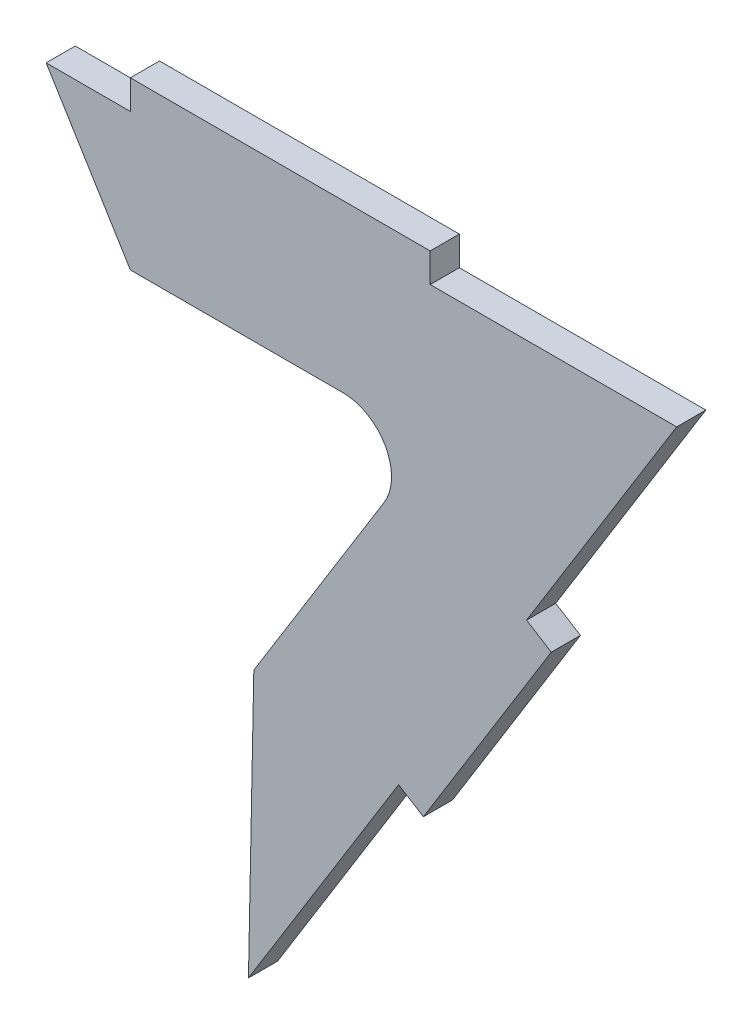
ISO-10303-21;
HEADER;
FILE_DESCRIPTION(('STEP AP214'),'2;1');
FILE_NAME('part.step','',(''),(''),'','','');
FILE_SCHEMA(('AUTOMOTIVE_DESIGN { 1 0 10303 214 1 1 1 1 }'));
ENDSEC;
DATA;
#1=APPLICATION_CONTEXT('core data for automotive mechanical design processes');
#2=APPLICATION_PROTOCOL_DEFINITION('international standard','automotive_design',2000,#1);
#3=PRODUCT_CONTEXT('',#1,'mechanical');
#4=PRODUCT('Part','Part','',(#3));
#5=PRODUCT_RELATED_PRODUCT_CATEGORY('part','',(#4));
#6=PRODUCT_DEFINITION_FORMATION('','',#4);
#7=PRODUCT_DEFINITION_CONTEXT('part definition',#1,'design');
#8=PRODUCT_DEFINITION('design','',#6,#7);
#9=PRODUCT_DEFINITION_SHAPE('','',#8);
#10=(LENGTH_UNIT() NAMED_UNIT(*) SI_UNIT(.MILLI.,.METRE.));
#11=(NAMED_UNIT(*) PLANE_ANGLE_UNIT() SI_UNIT($,.RADIAN.));
#12=(NAMED_UNIT(*) SI_UNIT($,.STERADIAN.) SOLID_ANGLE_UNIT());
#13=UNCERTAINTY_MEASURE_WITH_UNIT(LENGTH_MEASURE(1.E-05),#10,'distance_accuracy_value','');
#14=(GEOMETRIC_REPRESENTATION_CONTEXT(3) GLOBAL_UNCERTAINTY_ASSIGNED_CONTEXT((#13)) GLOBAL_UNIT_ASSIGNED_CONTEXT((#10,
#11,#12)) REPRESENTATION_CONTEXT('',''));
#15=CARTESIAN_POINT('',(0.,0.,0.));
#16=DIRECTION('',(0.,0.,1.));
#17=DIRECTION('',(1.,0.,0.));
#18=AXIS2_PLACEMENT_3D('',#15,#16,#17);
#19=CARTESIAN_POINT('',(40.2472484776,0.,1.524));
#20=DIRECTION('',(0.,-1.,0.));
#21=DIRECTION('',(1.,0.,0.));
#22=AXIS2_PLACEMENT_3D('',#19,#20,#21);
#23=PLANE('',#22);
#24=DIRECTION('',(-1.,0.,0.));
#25=VECTOR('',#24,1.);
#26=CARTESIAN_POINT('',(40.2472484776,0.,0.));
#27=LINE('',#26,#25);
#28=CARTESIAN_POINT('',(44.649794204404,0.,0.));
#29=VERTEX_POINT('',#28);
#30=CARTESIAN_POINT('',(40.2472484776,0.,0.));
#31=VERTEX_POINT('',#30);
#32=EDGE_CURVE('E174',#29,#31,#27,.T.);
#33=ORIENTED_EDGE('',*,*,#32,.T.);
#34=DIRECTION('',(0.,0.,-1.));
#35=VECTOR('',#34,1.);
#36=CARTESIAN_POINT('',(40.2472484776,0.,1.524));
#37=LINE('',#36,#35);
#38=CARTESIAN_POINT('',(40.2472484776,0.,1.524));
#39=VERTEX_POINT('',#38);
#40=EDGE_CURVE('E11',#39,#31,#37,.T.);
#41=ORIENTED_EDGE('',*,*,#40,.F.);
#42=DIRECTION('',(-1.,0.,0.));
#43=VECTOR('',#42,1.);
#44=CARTESIAN_POINT('',(40.2472484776,0.,1.524));
#45=LINE('',#44,#43);
#46=CARTESIAN_POINT('',(44.649794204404,0.,1.524));
#47=VERTEX_POINT('',#46);
#48=EDGE_CURVE('E202',#47,#39,#45,.T.);
#49=ORIENTED_EDGE('',*,*,#48,.F.);
#50=DIRECTION('',(0.,0.,-1.));
#51=VECTOR('',#50,1.);
#52=CARTESIAN_POINT('',(44.649794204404,0.,1.524));
#53=LINE('',#52,#51);
#54=EDGE_CURVE('E170',#47,#29,#53,.T.);
#55=ORIENTED_EDGE('',*,*,#54,.T.);
#56=EDGE_LOOP('',(#33,#41,#49,#55));
#57=FACE_BOUND('',#56,.T.);
#58=ADVANCED_FACE('F36',(#57),#23,.F.);
#59=CARTESIAN_POINT('',(40.2472484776,0.,1.524));
#60=DIRECTION('',(0.852442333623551,0.522821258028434,0.));
#61=DIRECTION('',(-0.522821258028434,0.852442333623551,0.));
#62=AXIS2_PLACEMENT_3D('',#59,#60,#61);
#63=PLANE('',#62);
#64=DIRECTION('',(0.522821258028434,-0.852442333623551,0.));
#65=VECTOR('',#64,1.);
#66=CARTESIAN_POINT('',(40.2472484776,0.,0.));
#67=LINE('',#66,#65);
#68=CARTESIAN_POINT('',(44.649794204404,-7.17820152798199,0.));
#69=VERTEX_POINT('',#68);
#70=EDGE_CURVE('E177',#31,#69,#67,.T.);
#71=ORIENTED_EDGE('',*,*,#70,.T.);
#72=DIRECTION('',(0.,0.,-1.));
#73=VECTOR('',#72,1.);
#74=CARTESIAN_POINT('',(44.649794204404,-7.17820152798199,1.524));
#75=LINE('',#74,#73);
#76=CARTESIAN_POINT('',(44.649794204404,-7.17820152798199,1.524));
#77=VERTEX_POINT('',#76);
#78=EDGE_CURVE('E44',#77,#69,#75,.T.);
#79=ORIENTED_EDGE('',*,*,#78,.F.);
#80=DIRECTION('',(0.522821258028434,-0.852442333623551,0.));
#81=VECTOR('',#80,1.);
#82=CARTESIAN_POINT('',(40.2472484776,0.,1.524));
#83=LINE('',#82,#81);
#84=EDGE_CURVE('E116',#39,#77,#83,.T.);
#85=ORIENTED_EDGE('',*,*,#84,.F.);
#86=ORIENTED_EDGE('',*,*,#40,.T.);
#87=EDGE_LOOP('',(#71,#79,#85,#86));
#88=FACE_BOUND('',#87,.T.);
#89=ADVANCED_FACE('F295',(#88),#63,.F.);
#90=CARTESIAN_POINT('',(55.7656315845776,-7.17820152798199,1.524));
#91=DIRECTION('',(0.,1.,0.));
#92=DIRECTION('',(0.,0.,1.));
#93=AXIS2_PLACEMENT_3D('',#90,#91,#92);
#94=PLANE('',#93);
#95=DIRECTION('',(1.,0.,0.));
#96=VECTOR('',#95,1.);
#97=CARTESIAN_POINT('',(55.7656315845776,-7.17820152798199,0.));
#98=LINE('',#97,#96);
#99=CARTESIAN_POINT('',(55.7656315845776,-7.17820152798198,0.));
#100=VERTEX_POINT('',#99);
#101=EDGE_CURVE('E179',#69,#100,#98,.T.);
#102=ORIENTED_EDGE('',*,*,#101,.T.);
#103=DIRECTION('',(0.,0.,-1.));
#104=VECTOR('',#103,1.);
#105=CARTESIAN_POINT('',(55.7656315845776,-7.17820152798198,1.524));
#106=LINE('',#105,#104);
#107=CARTESIAN_POINT('',(55.7656315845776,-7.17820152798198,1.524));
#108=VERTEX_POINT('',#107);
#109=EDGE_CURVE('E230',#108,#100,#106,.T.);
#110=ORIENTED_EDGE('',*,*,#109,.F.);
#111=DIRECTION('',(1.,0.,0.));
#112=VECTOR('',#111,1.);
#113=CARTESIAN_POINT('',(55.7656315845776,-7.17820152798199,1.524));
#114=LINE('',#113,#112);
#115=EDGE_CURVE('E238',#77,#108,#114,.T.);
#116=ORIENTED_EDGE('',*,*,#115,.F.);
#117=ORIENTED_EDGE('',*,*,#78,.T.);
#118=EDGE_LOOP('',(#102,#110,#116,#117));
#119=FACE_BOUND('',#118,.T.);
#120=ADVANCED_FACE('F236',(#119),#94,.F.);
#121=CARTESIAN_POINT('',(55.7656315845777,-9.71820152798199,1.524));
#122=DIRECTION('',(0.,0.,-1.));
#123=DIRECTION('',(-1.,0.,0.));
#124=AXIS2_PLACEMENT_3D('',#121,#122,#123);
#125=CYLINDRICAL_SURFACE('',#124,2.54);
#126=CARTESIAN_POINT('',(55.7656315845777,-9.71820152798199,0.));
#127=DIRECTION('',(0.,0.,-1.));
#128=DIRECTION('',(1.,0.,0.));
#129=AXIS2_PLACEMENT_3D('',#126,#127,#128);
#130=CIRCLE('',#129,2.54);
#131=CARTESIAN_POINT('',(57.9249608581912,-11.055698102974,0.));
#132=VERTEX_POINT('',#131);
#133=EDGE_CURVE('E181',#100,#132,#130,.T.);
#134=ORIENTED_EDGE('',*,*,#133,.T.);
#135=DIRECTION('',(0.,0.,-1.));
#136=VECTOR('',#135,1.);
#137=CARTESIAN_POINT('',(57.9249608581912,-11.055698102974,1.524));
#138=LINE('',#137,#136);
#139=CARTESIAN_POINT('',(57.9249608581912,-11.055698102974,1.524));
#140=VERTEX_POINT('',#139);
#141=EDGE_CURVE('E227',#140,#132,#138,.T.);
#142=ORIENTED_EDGE('',*,*,#141,.F.);
#143=CARTESIAN_POINT('',(55.7656315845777,-9.71820152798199,1.524));
#144=DIRECTION('',(0.,0.,-1.));
#145=DIRECTION('',(1.,0.,0.));
#146=AXIS2_PLACEMENT_3D('',#143,#144,#145);
#147=CIRCLE('',#146,2.54);
#148=EDGE_CURVE('E256',#108,#140,#147,.T.);
#149=ORIENTED_EDGE('',*,*,#148,.F.);
#150=ORIENTED_EDGE('',*,*,#109,.T.);
#151=EDGE_LOOP('',(#134,#142,#149,#150));
#152=FACE_BOUND('',#151,.T.);
#153=ADVANCED_FACE('F247',(#152),#125,.F.);
#154=CARTESIAN_POINT('',(51.1052575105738,-22.0658085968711,1.524));
#155=DIRECTION('',(0.850129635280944,-0.526573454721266,0.));
#156=DIRECTION('',(0.526573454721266,0.850129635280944,0.));
#157=AXIS2_PLACEMENT_3D('',#154,#155,#156);
#158=PLANE('',#157);
#159=DIRECTION('',(-0.526573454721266,-0.850129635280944,0.));
#160=VECTOR('',#159,1.);
#161=CARTESIAN_POINT('',(51.1052575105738,-22.0658085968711,0.));
#162=LINE('',#161,#160);
#163=CARTESIAN_POINT('',(51.1052575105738,-22.0658085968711,0.));
#164=VERTEX_POINT('',#163);
#165=EDGE_CURVE('E183',#132,#164,#162,.T.);
#166=ORIENTED_EDGE('',*,*,#165,.T.);
#167=DIRECTION('',(0.,0.,-1.));
#168=VECTOR('',#167,1.);
#169=CARTESIAN_POINT('',(51.1052575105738,-22.0658085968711,1.524));
#170=LINE('',#169,#168);
#171=CARTESIAN_POINT('',(51.1052575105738,-22.0658085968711,1.524));
#172=VERTEX_POINT('',#171);
#173=EDGE_CURVE('E224',#172,#164,#170,.T.);
#174=ORIENTED_EDGE('',*,*,#173,.F.);
#175=DIRECTION('',(-0.526573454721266,-0.850129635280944,0.));
#176=VECTOR('',#175,1.);
#177=CARTESIAN_POINT('',(51.1052575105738,-22.0658085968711,1.524));
#178=LINE('',#177,#176);
#179=EDGE_CURVE('E253',#140,#172,#178,.T.);
#180=ORIENTED_EDGE('',*,*,#179,.F.);
#181=ORIENTED_EDGE('',*,*,#141,.T.);
#182=EDGE_LOOP('',(#166,#174,#180,#181));
#183=FACE_BOUND('',#182,.T.);
#184=ADVANCED_FACE('F251',(#183),#158,.F.);
#185=CARTESIAN_POINT('',(50.8240315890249,-36.149103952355,1.524));
#186=DIRECTION('',(0.999800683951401,-0.0199647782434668,0.));
#187=DIRECTION('',(0.0199647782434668,0.999800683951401,0.));
#188=AXIS2_PLACEMENT_3D('',#185,#186,#187);
#189=PLANE('',#188);
#190=DIRECTION('',(-0.0199647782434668,-0.999800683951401,0.));
#191=VECTOR('',#190,1.);
#192=CARTESIAN_POINT('',(50.8240315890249,-36.149103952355,0.));
#193=LINE('',#192,#191);
#194=CARTESIAN_POINT('',(50.8240315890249,-36.149103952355,0.));
#195=VERTEX_POINT('',#194);
#196=EDGE_CURVE('E185',#164,#195,#193,.T.);
#197=ORIENTED_EDGE('',*,*,#196,.T.);
#198=DIRECTION('',(0.,0.,-1.));
#199=VECTOR('',#198,1.);
#200=CARTESIAN_POINT('',(50.8240315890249,-36.149103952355,1.524));
#201=LINE('',#200,#199);
#202=CARTESIAN_POINT('',(50.8240315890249,-36.149103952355,1.524));
#203=VERTEX_POINT('',#202);
#204=EDGE_CURVE('E221',#203,#195,#201,.T.);
#205=ORIENTED_EDGE('',*,*,#204,.F.);
#206=DIRECTION('',(-0.0199647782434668,-0.999800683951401,0.));
#207=VECTOR('',#206,1.);
#208=CARTESIAN_POINT('',(50.8240315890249,-36.149103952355,1.524));
#209=LINE('',#208,#207);
#210=EDGE_CURVE('E255',#172,#203,#209,.T.);
#211=ORIENTED_EDGE('',*,*,#210,.F.);
#212=ORIENTED_EDGE('',*,*,#173,.T.);
#213=EDGE_LOOP('',(#197,#205,#211,#212));
#214=FACE_BOUND('',#213,.T.);
#215=ADVANCED_FACE('F308',(#214),#189,.F.);
#216=CARTESIAN_POINT('',(58.675734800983,-23.4728751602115,1.524));
#217=DIRECTION('',(-0.850129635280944,0.526573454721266,0.));
#218=DIRECTION('',(-0.526573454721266,-0.850129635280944,0.));
#219=AXIS2_PLACEMENT_3D('',#216,#217,#218);
#220=PLANE('',#219);
#221=DIRECTION('',(0.526573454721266,0.850129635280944,0.));
#222=VECTOR('',#221,1.);
#223=CARTESIAN_POINT('',(58.675734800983,-23.4728751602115,0.));
#224=LINE('',#223,#222);
#225=CARTESIAN_POINT('',(58.675734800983,-23.4728751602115,0.));
#226=VERTEX_POINT('',#225);
#227=EDGE_CURVE('E187',#195,#226,#224,.T.);
#228=ORIENTED_EDGE('',*,*,#227,.T.);
#229=DIRECTION('',(0.,0.,-1.));
#230=VECTOR('',#229,1.);
#231=CARTESIAN_POINT('',(58.675734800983,-23.4728751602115,1.524));
#232=LINE('',#231,#230);
#233=CARTESIAN_POINT('',(58.675734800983,-23.4728751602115,1.524));
#234=VERTEX_POINT('',#233);
#235=EDGE_CURVE('E218',#234,#226,#232,.T.);
#236=ORIENTED_EDGE('',*,*,#235,.F.);
#237=DIRECTION('',(0.526573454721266,0.850129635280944,0.));
#238=VECTOR('',#237,1.);
#239=CARTESIAN_POINT('',(58.675734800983,-23.4728751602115,1.524));
#240=LINE('',#239,#238);
#241=EDGE_CURVE('E258',#203,#234,#240,.T.);
#242=ORIENTED_EDGE('',*,*,#241,.F.);
#243=ORIENTED_EDGE('',*,*,#204,.T.);
#244=EDGE_LOOP('',(#228,#236,#242,#243));
#245=FACE_BOUND('',#244,.T.);
#246=ADVANCED_FACE('F311',(#245),#220,.F.);
#247=CARTESIAN_POINT('',(58.675734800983,-23.4728751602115,1.524));
#248=DIRECTION('',(0.526573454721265,0.850129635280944,0.));
#249=DIRECTION('',(-0.850129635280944,0.526573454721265,0.));
#250=AXIS2_PLACEMENT_3D('',#247,#248,#249);
#251=PLANE('',#250);
#252=DIRECTION('',(0.850129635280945,-0.526573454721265,0.));
#253=VECTOR('',#252,1.);
#254=CARTESIAN_POINT('',(58.675734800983,-23.4728751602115,0.));
#255=LINE('',#254,#253);
#256=CARTESIAN_POINT('',(59.9713323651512,-24.2753731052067,0.));
#257=VERTEX_POINT('',#256);
#258=EDGE_CURVE('E189',#226,#257,#255,.T.);
#259=ORIENTED_EDGE('',*,*,#258,.T.);
#260=DIRECTION('',(0.,0.,-1.));
#261=VECTOR('',#260,1.);
#262=CARTESIAN_POINT('',(59.9713323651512,-24.2753731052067,1.524));
#263=LINE('',#262,#261);
#264=CARTESIAN_POINT('',(59.9713323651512,-24.2753731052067,1.524));
#265=VERTEX_POINT('',#264);
#266=EDGE_CURVE('E215',#265,#257,#263,.T.);
#267=ORIENTED_EDGE('',*,*,#266,.F.);
#268=DIRECTION('',(0.850129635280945,-0.526573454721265,0.));
#269=VECTOR('',#268,1.);
#270=CARTESIAN_POINT('',(58.675734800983,-23.4728751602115,1.524));
#271=LINE('',#270,#269);
#272=EDGE_CURVE('E264',#234,#265,#271,.T.);
#273=ORIENTED_EDGE('',*,*,#272,.F.);
#274=ORIENTED_EDGE('',*,*,#235,.T.);
#275=EDGE_LOOP('',(#259,#267,#273,#274));
#276=FACE_BOUND('',#275,.T.);
#277=ADVANCED_FACE('F315',(#276),#251,.F.);
#278=CARTESIAN_POINT('',(66.6588152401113,-13.4787267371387,1.524));
#279=DIRECTION('',(-0.850129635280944,0.526573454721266,0.));
#280=DIRECTION('',(-0.526573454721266,-0.850129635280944,0.));
#281=AXIS2_PLACEMENT_3D('',#278,#279,#280);
#282=PLANE('',#281);
#283=DIRECTION('',(0.526573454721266,0.850129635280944,0.));
#284=VECTOR('',#283,1.);
#285=CARTESIAN_POINT('',(66.6588152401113,-13.4787267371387,0.));
#286=LINE('',#285,#284);
#287=CARTESIAN_POINT('',(66.6588152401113,-13.4787267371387,0.));
#288=VERTEX_POINT('',#287);
#289=EDGE_CURVE('E191',#257,#288,#286,.T.);
#290=ORIENTED_EDGE('',*,*,#289,.T.);
#291=DIRECTION('',(0.,0.,-1.));
#292=VECTOR('',#291,1.);
#293=CARTESIAN_POINT('',(66.6588152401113,-13.4787267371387,1.524));
#294=LINE('',#293,#292);
#295=CARTESIAN_POINT('',(66.6588152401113,-13.4787267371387,1.524));
#296=VERTEX_POINT('',#295);
#297=EDGE_CURVE('E212',#296,#288,#294,.T.);
#298=ORIENTED_EDGE('',*,*,#297,.F.);
#299=DIRECTION('',(0.526573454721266,0.850129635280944,0.));
#300=VECTOR('',#299,1.);
#301=CARTESIAN_POINT('',(66.6588152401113,-13.4787267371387,1.524));
#302=LINE('',#301,#300);
#303=EDGE_CURVE('E266',#265,#296,#302,.T.);
#304=ORIENTED_EDGE('',*,*,#303,.F.);
#305=ORIENTED_EDGE('',*,*,#266,.T.);
#306=EDGE_LOOP('',(#290,#298,#304,#305));
#307=FACE_BOUND('',#306,.T.);
#308=ADVANCED_FACE('F319',(#307),#282,.F.);
#309=CARTESIAN_POINT('',(65.3632176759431,-12.6762287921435,1.524));
#310=DIRECTION('',(-0.526573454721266,-0.850129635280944,0.));
#311=DIRECTION('',(0.850129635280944,-0.526573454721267,0.));
#312=AXIS2_PLACEMENT_3D('',#309,#310,#311);
#313=PLANE('',#312);
#314=DIRECTION('',(-0.850129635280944,0.526573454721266,0.));
#315=VECTOR('',#314,1.);
#316=CARTESIAN_POINT('',(65.3632176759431,-12.6762287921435,0.));
#317=LINE('',#316,#315);
#318=CARTESIAN_POINT('',(65.3632176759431,-12.6762287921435,0.));
#319=VERTEX_POINT('',#318);
#320=EDGE_CURVE('E193',#288,#319,#317,.T.);
#321=ORIENTED_EDGE('',*,*,#320,.T.);
#322=DIRECTION('',(0.,0.,-1.));
#323=VECTOR('',#322,1.);
#324=CARTESIAN_POINT('',(65.3632176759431,-12.6762287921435,1.524));
#325=LINE('',#324,#323);
#326=CARTESIAN_POINT('',(65.3632176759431,-12.6762287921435,1.524));
#327=VERTEX_POINT('',#326);
#328=EDGE_CURVE('E209',#327,#319,#325,.T.);
#329=ORIENTED_EDGE('',*,*,#328,.F.);
#330=DIRECTION('',(-0.850129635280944,0.526573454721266,0.));
#331=VECTOR('',#330,1.);
#332=CARTESIAN_POINT('',(65.3632176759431,-12.6762287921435,1.524));
#333=LINE('',#332,#331);
#334=EDGE_CURVE('E268',#296,#327,#333,.T.);
#335=ORIENTED_EDGE('',*,*,#334,.F.);
#336=ORIENTED_EDGE('',*,*,#297,.T.);
#337=EDGE_LOOP('',(#321,#329,#335,#336));
#338=FACE_BOUND('',#337,.T.);
#339=ADVANCED_FACE('F323',(#338),#313,.F.);
#340=CARTESIAN_POINT('',(73.2149208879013,0.,1.524));
#341=DIRECTION('',(-0.850129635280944,0.526573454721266,0.));
#342=DIRECTION('',(-0.526573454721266,-0.850129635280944,0.));
#343=AXIS2_PLACEMENT_3D('',#340,#341,#342);
#344=PLANE('',#343);
#345=DIRECTION('',(0.526573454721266,0.850129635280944,0.));
#346=VECTOR('',#345,1.);
#347=CARTESIAN_POINT('',(73.2149208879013,0.,0.));
#348=LINE('',#347,#346);
#349=CARTESIAN_POINT('',(73.2149208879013,0.,0.));
#350=VERTEX_POINT('',#349);
#351=EDGE_CURVE('E195',#319,#350,#348,.T.);
#352=ORIENTED_EDGE('',*,*,#351,.T.);
#353=DIRECTION('',(0.,0.,-1.));
#354=VECTOR('',#353,1.);
#355=CARTESIAN_POINT('',(73.2149208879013,0.,1.524));
#356=LINE('',#355,#354);
#357=CARTESIAN_POINT('',(73.2149208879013,0.,1.524));
#358=VERTEX_POINT('',#357);
#359=EDGE_CURVE('E206',#358,#350,#356,.T.);
#360=ORIENTED_EDGE('',*,*,#359,.F.);
#361=DIRECTION('',(0.526573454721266,0.850129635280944,0.));
#362=VECTOR('',#361,1.);
#363=CARTESIAN_POINT('',(73.2149208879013,0.,1.524));
#364=LINE('',#363,#362);
#365=EDGE_CURVE('E270',#327,#358,#364,.T.);
#366=ORIENTED_EDGE('',*,*,#365,.F.);
#367=ORIENTED_EDGE('',*,*,#328,.T.);
#368=EDGE_LOOP('',(#352,#360,#366,#367));
#369=FACE_BOUND('',#368,.T.);
#370=ADVANCED_FACE('F276',(#369),#344,.F.);
#371=CARTESIAN_POINT('',(60.3266966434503,0.,1.524));
#372=DIRECTION('',(0.,-1.,0.));
#373=DIRECTION('',(0.,0.,-1.));
#374=AXIS2_PLACEMENT_3D('',#371,#372,#373);
#375=PLANE('',#374);
#376=DIRECTION('',(-1.,0.,0.));
#377=VECTOR('',#376,1.);
#378=CARTESIAN_POINT('',(60.3266966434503,0.,0.));
#379=LINE('',#378,#377);
#380=CARTESIAN_POINT('',(60.3266966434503,0.,0.));
#381=VERTEX_POINT('',#380);
#382=EDGE_CURVE('E197',#350,#381,#379,.T.);
#383=ORIENTED_EDGE('',*,*,#382,.T.);
#384=DIRECTION('',(0.,0.,-1.));
#385=VECTOR('',#384,1.);
#386=CARTESIAN_POINT('',(60.3266966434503,0.,1.524));
#387=LINE('',#386,#385);
#388=CARTESIAN_POINT('',(60.3266966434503,0.,1.524));
#389=VERTEX_POINT('',#388);
#390=EDGE_CURVE('E165',#389,#381,#387,.T.);
#391=ORIENTED_EDGE('',*,*,#390,.F.);
#392=DIRECTION('',(-1.,0.,0.));
#393=VECTOR('',#392,1.);
#394=CARTESIAN_POINT('',(60.3266966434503,0.,1.524));
#395=LINE('',#394,#393);
#396=EDGE_CURVE('E156',#358,#389,#395,.T.);
#397=ORIENTED_EDGE('',*,*,#396,.F.);
#398=ORIENTED_EDGE('',*,*,#359,.T.);
#399=EDGE_LOOP('',(#383,#391,#397,#398));
#400=FACE_BOUND('',#399,.T.);
#401=ADVANCED_FACE('F280',(#400),#375,.F.);
#402=CARTESIAN_POINT('',(60.3266966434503,1.524,1.524));
#403=DIRECTION('',(-1.,0.,0.));
#404=DIRECTION('',(0.,0.,1.));
#405=AXIS2_PLACEMENT_3D('',#402,#403,#404);
#406=PLANE('',#405);
#407=DIRECTION('',(0.,1.,0.));
#408=VECTOR('',#407,1.);
#409=CARTESIAN_POINT('',(60.3266966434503,1.524,0.));
#410=LINE('',#409,#408);
#411=CARTESIAN_POINT('',(60.3266966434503,1.524,0.));
#412=VERTEX_POINT('',#411);
#413=EDGE_CURVE('E164',#381,#412,#410,.T.);
#414=ORIENTED_EDGE('',*,*,#413,.T.);
#415=DIRECTION('',(0.,0.,-1.));
#416=VECTOR('',#415,1.);
#417=CARTESIAN_POINT('',(60.3266966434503,1.524,1.524));
#418=LINE('',#417,#416);
#419=CARTESIAN_POINT('',(60.3266966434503,1.524,1.524));
#420=VERTEX_POINT('',#419);
#421=EDGE_CURVE('E161',#420,#412,#418,.T.);
#422=ORIENTED_EDGE('',*,*,#421,.F.);
#423=DIRECTION('',(0.,1.,0.));
#424=VECTOR('',#423,1.);
#425=CARTESIAN_POINT('',(60.3266966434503,1.524,1.524));
#426=LINE('',#425,#424);
#427=EDGE_CURVE('E150',#389,#420,#426,.T.);
#428=ORIENTED_EDGE('',*,*,#427,.F.);
#429=ORIENTED_EDGE('',*,*,#390,.T.);
#430=EDGE_LOOP('',(#414,#422,#428,#429));
#431=FACE_BOUND('',#430,.T.);
#432=ADVANCED_FACE('F162',(#431),#406,.F.);
#433=CARTESIAN_POINT('',(44.649794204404,1.524,1.524));
#434=DIRECTION('',(0.,-1.,0.));
#435=DIRECTION('',(0.,0.,-1.));
#436=AXIS2_PLACEMENT_3D('',#433,#434,#435);
#437=PLANE('',#436);
#438=DIRECTION('',(-1.,0.,0.));
#439=VECTOR('',#438,1.);
#440=CARTESIAN_POINT('',(44.649794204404,1.524,0.));
#441=LINE('',#440,#439);
#442=CARTESIAN_POINT('',(44.649794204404,1.524,0.));
#443=VERTEX_POINT('',#442);
#444=EDGE_CURVE('E102',#412,#443,#441,.T.);
#445=ORIENTED_EDGE('',*,*,#444,.T.);
#446=DIRECTION('',(0.,0.,-1.));
#447=VECTOR('',#446,1.);
#448=CARTESIAN_POINT('',(44.649794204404,1.524,1.524));
#449=LINE('',#448,#447);
#450=CARTESIAN_POINT('',(44.649794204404,1.524,1.524));
#451=VERTEX_POINT('',#450);
#452=EDGE_CURVE('E166',#451,#443,#449,.T.);
#453=ORIENTED_EDGE('',*,*,#452,.F.);
#454=DIRECTION('',(-1.,0.,0.));
#455=VECTOR('',#454,1.);
#456=CARTESIAN_POINT('',(44.649794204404,1.524,1.524));
#457=LINE('',#456,#455);
#458=EDGE_CURVE('E154',#420,#451,#457,.T.);
#459=ORIENTED_EDGE('',*,*,#458,.F.);
#460=ORIENTED_EDGE('',*,*,#421,.T.);
#461=EDGE_LOOP('',(#445,#453,#459,#460));
#462=FACE_BOUND('',#461,.T.);
#463=ADVANCED_FACE('F168',(#462),#437,.F.);
#464=CARTESIAN_POINT('',(44.649794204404,0.,1.524));
#465=DIRECTION('',(1.,0.,0.));
#466=DIRECTION('',(0.,0.,-1.));
#467=AXIS2_PLACEMENT_3D('',#464,#465,#466);
#468=PLANE('',#467);
#469=DIRECTION('',(0.,-1.,0.));
#470=VECTOR('',#469,1.);
#471=CARTESIAN_POINT('',(44.649794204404,0.,0.));
#472=LINE('',#471,#470);
#473=EDGE_CURVE('E108',#443,#29,#472,.T.);
#474=ORIENTED_EDGE('',*,*,#473,.T.);
#475=ORIENTED_EDGE('',*,*,#54,.F.);
#476=DIRECTION('',(0.,-1.,0.));
#477=VECTOR('',#476,1.);
#478=CARTESIAN_POINT('',(44.649794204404,0.,1.524));
#479=LINE('',#478,#477);
#480=EDGE_CURVE('E52',#451,#47,#479,.T.);
#481=ORIENTED_EDGE('',*,*,#480,.F.);
#482=ORIENTED_EDGE('',*,*,#452,.T.);
#483=EDGE_LOOP('',(#474,#475,#481,#482));
#484=FACE_BOUND('',#483,.T.);
#485=ADVANCED_FACE('F284',(#484),#468,.F.);
#486=CARTESIAN_POINT('',(55.7656315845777,-9.71820152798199,1.524));
#487=DIRECTION('',(0.,0.,1.));
#488=DIRECTION('',(1.,0.,0.));
#489=AXIS2_PLACEMENT_3D('',#486,#487,#488);
#490=PLANE('',#489);
#491=ORIENTED_EDGE('',*,*,#48,.T.);
#492=ORIENTED_EDGE('',*,*,#84,.T.);
#493=ORIENTED_EDGE('',*,*,#115,.T.);
#494=ORIENTED_EDGE('',*,*,#148,.T.);
#495=ORIENTED_EDGE('',*,*,#179,.T.);
#496=ORIENTED_EDGE('',*,*,#210,.T.);
#497=ORIENTED_EDGE('',*,*,#241,.T.);
#498=ORIENTED_EDGE('',*,*,#272,.T.);
#499=ORIENTED_EDGE('',*,*,#303,.T.);
#500=ORIENTED_EDGE('',*,*,#334,.T.);
#501=ORIENTED_EDGE('',*,*,#365,.T.);
#502=ORIENTED_EDGE('',*,*,#396,.T.);
#503=ORIENTED_EDGE('',*,*,#427,.T.);
#504=ORIENTED_EDGE('',*,*,#458,.T.);
#505=ORIENTED_EDGE('',*,*,#480,.T.);
#506=EDGE_LOOP('',(#491,#492,#493,#494,#495,#496,#497,#498,#499,#500,#501,#502,#503,#504,#505));
#507=FACE_BOUND('',#506,.T.);
#508=ADVANCED_FACE('F152',(#507),#490,.T.);
#509=CARTESIAN_POINT('',(55.7656315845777,-9.71820152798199,0.));
#510=DIRECTION('',(0.,0.,1.));
#511=DIRECTION('',(1.,0.,0.));
#512=AXIS2_PLACEMENT_3D('',#509,#510,#511);
#513=PLANE('',#512);
#514=ORIENTED_EDGE('',*,*,#32,.F.);
#515=ORIENTED_EDGE('',*,*,#473,.F.);
#516=ORIENTED_EDGE('',*,*,#444,.F.);
#517=ORIENTED_EDGE('',*,*,#413,.F.);
#518=ORIENTED_EDGE('',*,*,#382,.F.);
#519=ORIENTED_EDGE('',*,*,#351,.F.);
#520=ORIENTED_EDGE('',*,*,#320,.F.);
#521=ORIENTED_EDGE('',*,*,#289,.F.);
#522=ORIENTED_EDGE('',*,*,#258,.F.);
#523=ORIENTED_EDGE('',*,*,#227,.F.);
#524=ORIENTED_EDGE('',*,*,#196,.F.);
#525=ORIENTED_EDGE('',*,*,#165,.F.);
#526=ORIENTED_EDGE('',*,*,#133,.F.);
#527=ORIENTED_EDGE('',*,*,#101,.F.);
#528=ORIENTED_EDGE('',*,*,#70,.F.);
#529=EDGE_LOOP('',(#514,#515,#516,#517,#518,#519,#520,#521,#522,#523,#524,#525,#526,#527,#528));
#530=FACE_BOUND('',#529,.T.);
#531=ADVANCED_FACE('F242',(#530),#513,.F.);
#532=CLOSED_SHELL('',(#58,#89,#120,#153,#184,#215,#246,#277,#308,#339,#370,#401,#432,#463,#485,
#508,#531));
#533=MANIFOLD_SOLID_BREP('B2',#532);
#534=ADVANCED_BREP_SHAPE_REPRESENTATION('',(#18,#533),#14);
#535=SHAPE_DEFINITION_REPRESENTATION(#9,#534);
ENDSEC;
END-ISO-10303-21;
